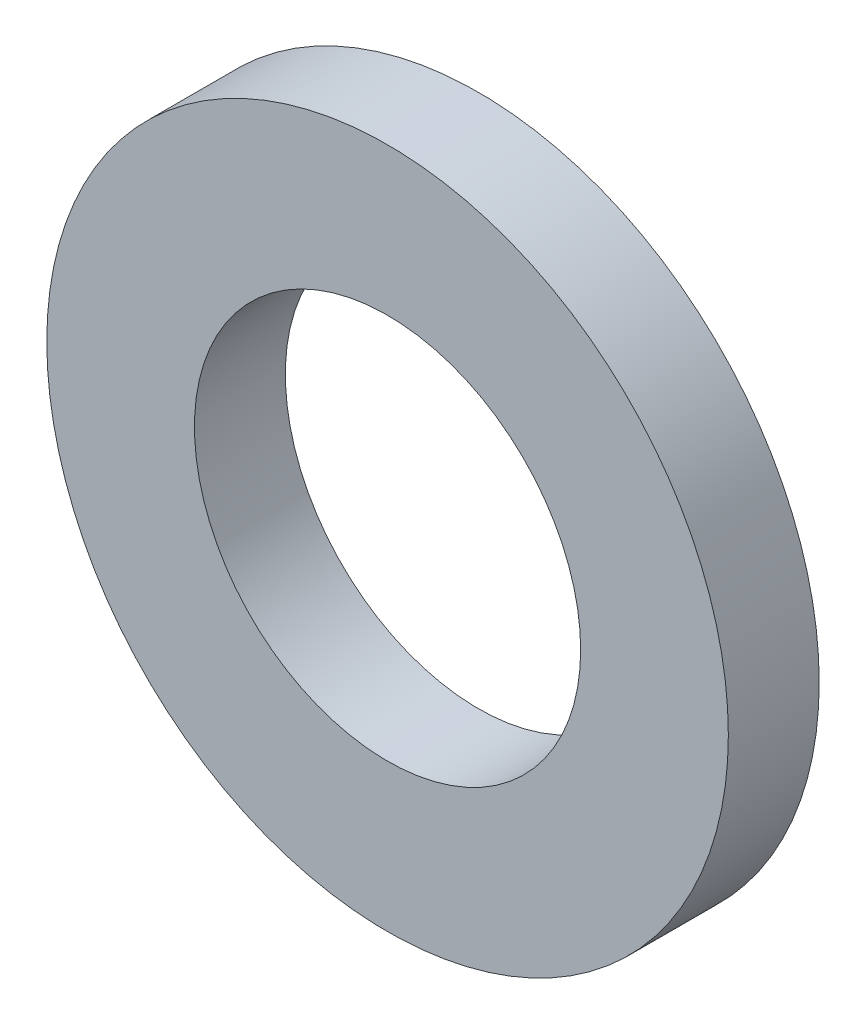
ISO-10303-21;
HEADER;
FILE_DESCRIPTION(('STEP AP214'),'2;1');
FILE_NAME('part.step','',(''),(''),'','','');
FILE_SCHEMA(('AUTOMOTIVE_DESIGN { 1 0 10303 214 1 1 1 1 }'));
ENDSEC;
DATA;
#1=APPLICATION_CONTEXT('core data for automotive mechanical design processes');
#2=APPLICATION_PROTOCOL_DEFINITION('international standard','automotive_design',2000,#1);
#3=PRODUCT_CONTEXT('',#1,'mechanical');
#4=PRODUCT('Part','Part','',(#3));
#5=PRODUCT_RELATED_PRODUCT_CATEGORY('part','',(#4));
#6=PRODUCT_DEFINITION_FORMATION('','',#4);
#7=PRODUCT_DEFINITION_CONTEXT('part definition',#1,'design');
#8=PRODUCT_DEFINITION('design','',#6,#7);
#9=PRODUCT_DEFINITION_SHAPE('','',#8);
#10=(LENGTH_UNIT() NAMED_UNIT(*) SI_UNIT(.MILLI.,.METRE.));
#11=(NAMED_UNIT(*) PLANE_ANGLE_UNIT() SI_UNIT($,.RADIAN.));
#12=(NAMED_UNIT(*) SI_UNIT($,.STERADIAN.) SOLID_ANGLE_UNIT());
#13=UNCERTAINTY_MEASURE_WITH_UNIT(LENGTH_MEASURE(1.E-05),#10,'distance_accuracy_value','');
#14=(GEOMETRIC_REPRESENTATION_CONTEXT(3) GLOBAL_UNCERTAINTY_ASSIGNED_CONTEXT((#13)) GLOBAL_UNIT_ASSIGNED_CONTEXT((#10,
#11,#12)) REPRESENTATION_CONTEXT('',''));
#15=CARTESIAN_POINT('',(0.,0.,0.));
#16=DIRECTION('',(0.,0.,1.));
#17=DIRECTION('',(1.,0.,0.));
#18=AXIS2_PLACEMENT_3D('',#15,#16,#17);
#19=CARTESIAN_POINT('',(0.,0.,1.016));
#20=DIRECTION('',(0.,0.,1.));
#21=DIRECTION('',(1.,0.,0.));
#22=AXIS2_PLACEMENT_3D('',#19,#20,#21);
#23=PLANE('',#22);
#24=CARTESIAN_POINT('',(0.,0.,1.016));
#25=DIRECTION('',(0.,0.,1.));
#26=DIRECTION('',(1.,0.,0.));
#27=AXIS2_PLACEMENT_3D('',#24,#25,#26);
#28=CIRCLE('',#27,3.81);
#29=CARTESIAN_POINT('',(3.81,0.,1.016));
#30=VERTEX_POINT('',#29);
#31=EDGE_CURVE('E10',#30,#30,#28,.T.);
#32=ORIENTED_EDGE('',*,*,#31,.T.);
#33=EDGE_LOOP('',(#32));
#34=FACE_BOUND('',#33,.T.);
#35=CARTESIAN_POINT('',(0.,0.,1.016));
#36=DIRECTION('',(0.,0.,1.));
#37=DIRECTION('',(1.,0.,0.));
#38=AXIS2_PLACEMENT_3D('',#35,#36,#37);
#39=CIRCLE('',#38,2.159);
#40=CARTESIAN_POINT('',(2.159,0.,1.016));
#41=VERTEX_POINT('',#40);
#42=EDGE_CURVE('E42',#41,#41,#39,.T.);
#43=ORIENTED_EDGE('',*,*,#42,.F.);
#44=EDGE_LOOP('',(#43));
#45=FACE_BOUND('',#44,.T.);
#46=ADVANCED_FACE('F31',(#34,#45),#23,.T.);
#47=CARTESIAN_POINT('',(0.,0.,0.));
#48=DIRECTION('',(0.,0.,1.));
#49=DIRECTION('',(1.,0.,0.));
#50=AXIS2_PLACEMENT_3D('',#47,#48,#49);
#51=PLANE('',#50);
#52=CARTESIAN_POINT('',(0.,0.,0.));
#53=DIRECTION('',(0.,0.,1.));
#54=DIRECTION('',(1.,0.,0.));
#55=AXIS2_PLACEMENT_3D('',#52,#53,#54);
#56=CIRCLE('',#55,3.81);
#57=CARTESIAN_POINT('',(3.81,0.,0.));
#58=VERTEX_POINT('',#57);
#59=EDGE_CURVE('E35',#58,#58,#56,.T.);
#60=ORIENTED_EDGE('',*,*,#59,.F.);
#61=EDGE_LOOP('',(#60));
#62=FACE_BOUND('',#61,.T.);
#63=CARTESIAN_POINT('',(0.,0.,0.));
#64=DIRECTION('',(0.,0.,1.));
#65=DIRECTION('',(1.,0.,0.));
#66=AXIS2_PLACEMENT_3D('',#63,#64,#65);
#67=CIRCLE('',#66,2.159);
#68=CARTESIAN_POINT('',(2.159,0.,0.));
#69=VERTEX_POINT('',#68);
#70=EDGE_CURVE('E44',#69,#69,#67,.T.);
#71=ORIENTED_EDGE('',*,*,#70,.T.);
#72=EDGE_LOOP('',(#71));
#73=FACE_BOUND('',#72,.T.);
#74=ADVANCED_FACE('F54',(#62,#73),#51,.F.);
#75=CARTESIAN_POINT('',(0.,0.,1.016));
#76=DIRECTION('',(0.,0.,-1.));
#77=DIRECTION('',(-1.,0.,0.));
#78=AXIS2_PLACEMENT_3D('',#75,#76,#77);
#79=CYLINDRICAL_SURFACE('',#78,3.81);
#80=ORIENTED_EDGE('',*,*,#31,.F.);
#81=EDGE_LOOP('',(#80));
#82=FACE_BOUND('',#81,.T.);
#83=ORIENTED_EDGE('',*,*,#59,.T.);
#84=EDGE_LOOP('',(#83));
#85=FACE_BOUND('',#84,.T.);
#86=ADVANCED_FACE('F33',(#82,#85),#79,.T.);
#87=CARTESIAN_POINT('',(0.,0.,1.016));
#88=DIRECTION('',(0.,0.,-1.));
#89=DIRECTION('',(-1.,0.,0.));
#90=AXIS2_PLACEMENT_3D('',#87,#88,#89);
#91=CYLINDRICAL_SURFACE('',#90,2.159);
#92=ORIENTED_EDGE('',*,*,#42,.T.);
#93=EDGE_LOOP('',(#92));
#94=FACE_BOUND('',#93,.T.);
#95=ORIENTED_EDGE('',*,*,#70,.F.);
#96=EDGE_LOOP('',(#95));
#97=FACE_BOUND('',#96,.T.);
#98=ADVANCED_FACE('F50',(#94,#97),#91,.F.);
#99=CLOSED_SHELL('',(#46,#74,#86,#98));
#100=MANIFOLD_SOLID_BREP('B2',#99);
#101=ADVANCED_BREP_SHAPE_REPRESENTATION('',(#18,#100),#14);
#102=SHAPE_DEFINITION_REPRESENTATION(#9,#101);
ENDSEC;
END-ISO-10303-21;
